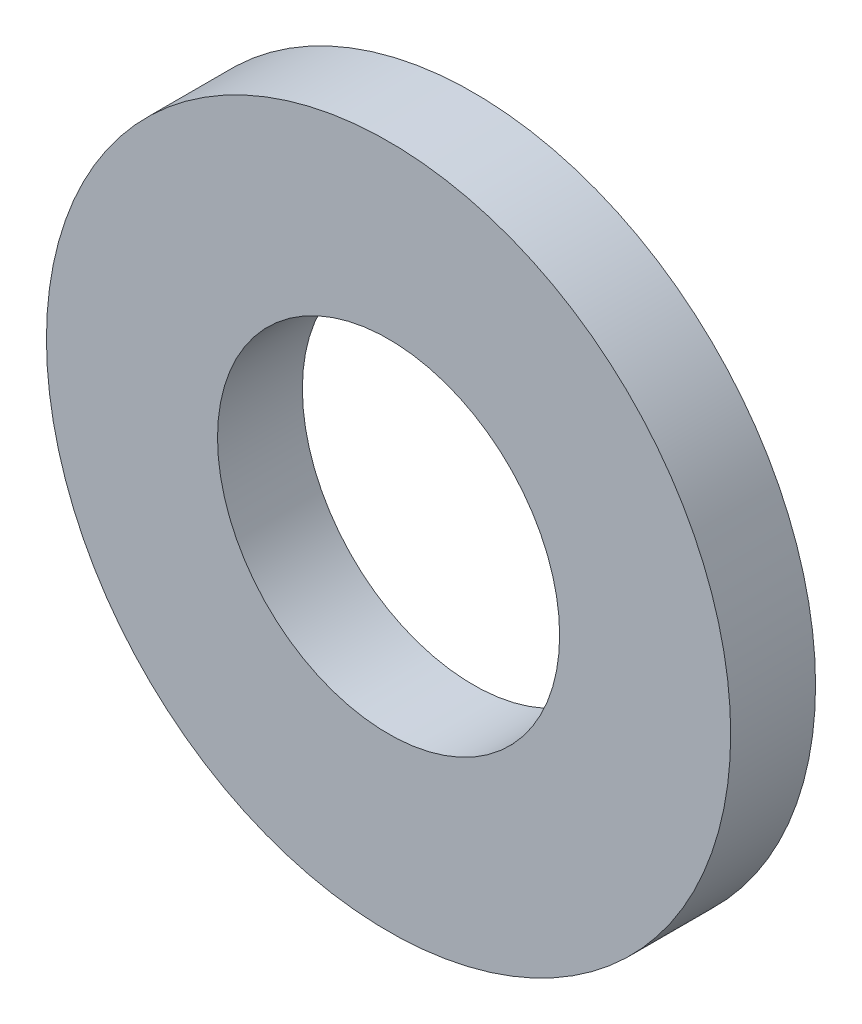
ISO-10303-21;
HEADER;
FILE_DESCRIPTION(('STEP AP214'),'2;1');
FILE_NAME('part.step','',(''),(''),'','','');
FILE_SCHEMA(('AUTOMOTIVE_DESIGN { 1 0 10303 214 1 1 1 1 }'));
ENDSEC;
DATA;
#1=APPLICATION_CONTEXT('core data for automotive mechanical design processes');
#2=APPLICATION_PROTOCOL_DEFINITION('international standard','automotive_design',2000,#1);
#3=PRODUCT_CONTEXT('',#1,'mechanical');
#4=PRODUCT('Part','Part','',(#3));
#5=PRODUCT_RELATED_PRODUCT_CATEGORY('part','',(#4));
#6=PRODUCT_DEFINITION_FORMATION('','',#4);
#7=PRODUCT_DEFINITION_CONTEXT('part definition',#1,'design');
#8=PRODUCT_DEFINITION('design','',#6,#7);
#9=PRODUCT_DEFINITION_SHAPE('','',#8);
#10=(LENGTH_UNIT() NAMED_UNIT(*) SI_UNIT(.MILLI.,.METRE.));
#11=(NAMED_UNIT(*) PLANE_ANGLE_UNIT() SI_UNIT($,.RADIAN.));
#12=(NAMED_UNIT(*) SI_UNIT($,.STERADIAN.) SOLID_ANGLE_UNIT());
#13=UNCERTAINTY_MEASURE_WITH_UNIT(LENGTH_MEASURE(1.E-05),#10,'distance_accuracy_value','');
#14=(GEOMETRIC_REPRESENTATION_CONTEXT(3) GLOBAL_UNCERTAINTY_ASSIGNED_CONTEXT((#13)) GLOBAL_UNIT_ASSIGNED_CONTEXT((#10,
#11,#12)) REPRESENTATION_CONTEXT('',''));
#15=CARTESIAN_POINT('',(0.,0.,0.));
#16=DIRECTION('',(0.,0.,1.));
#17=DIRECTION('',(1.,0.,0.));
#18=AXIS2_PLACEMENT_3D('',#15,#16,#17);
#19=CARTESIAN_POINT('',(0.,0.,0.7874));
#20=DIRECTION('',(0.,0.,1.));
#21=DIRECTION('',(1.,0.,0.));
#22=AXIS2_PLACEMENT_3D('',#19,#20,#21);
#23=PLANE('',#22);
#24=CARTESIAN_POINT('',(0.,0.,0.7874));
#25=DIRECTION('',(0.,0.,1.));
#26=DIRECTION('',(1.,0.,0.));
#27=AXIS2_PLACEMENT_3D('',#24,#25,#26);
#28=CIRCLE('',#27,6.35);
#29=CARTESIAN_POINT('',(6.35,0.,0.7874));
#30=VERTEX_POINT('',#29);
#31=EDGE_CURVE('E10',#30,#30,#28,.T.);
#32=ORIENTED_EDGE('',*,*,#31,.T.);
#33=EDGE_LOOP('',(#32));
#34=FACE_BOUND('',#33,.T.);
#35=CARTESIAN_POINT('',(0.,0.,0.7874));
#36=DIRECTION('',(0.,0.,1.));
#37=DIRECTION('',(1.,0.,0.));
#38=AXIS2_PLACEMENT_3D('',#35,#36,#37);
#39=CIRCLE('',#38,3.175);
#40=CARTESIAN_POINT('',(3.175,0.,0.7874));
#41=VERTEX_POINT('',#40);
#42=EDGE_CURVE('E37',#41,#41,#39,.T.);
#43=ORIENTED_EDGE('',*,*,#42,.F.);
#44=EDGE_LOOP('',(#43));
#45=FACE_BOUND('',#44,.T.);
#46=ADVANCED_FACE('F30',(#34,#45),#23,.T.);
#47=CARTESIAN_POINT('',(0.,0.,0.7874));
#48=DIRECTION('',(0.,0.,-1.));
#49=DIRECTION('',(-1.,0.,0.));
#50=AXIS2_PLACEMENT_3D('',#47,#48,#49);
#51=CYLINDRICAL_SURFACE('',#50,6.35);
#52=ORIENTED_EDGE('',*,*,#31,.F.);
#53=EDGE_LOOP('',(#52));
#54=FACE_BOUND('',#53,.T.);
#55=CARTESIAN_POINT('',(0.,0.,-0.7874));
#56=DIRECTION('',(0.,0.,1.));
#57=DIRECTION('',(1.,0.,0.));
#58=AXIS2_PLACEMENT_3D('',#55,#56,#57);
#59=CIRCLE('',#58,6.35);
#60=CARTESIAN_POINT('',(6.35,0.,-0.7874));
#61=VERTEX_POINT('',#60);
#62=EDGE_CURVE('E41',#61,#61,#59,.T.);
#63=ORIENTED_EDGE('',*,*,#62,.T.);
#64=EDGE_LOOP('',(#63));
#65=FACE_BOUND('',#64,.T.);
#66=ADVANCED_FACE('F32',(#54,#65),#51,.T.);
#67=CARTESIAN_POINT('',(0.,0.,0.7874));
#68=DIRECTION('',(0.,0.,-1.));
#69=DIRECTION('',(-1.,0.,0.));
#70=AXIS2_PLACEMENT_3D('',#67,#68,#69);
#71=CYLINDRICAL_SURFACE('',#70,3.175);
#72=ORIENTED_EDGE('',*,*,#42,.T.);
#73=EDGE_LOOP('',(#72));
#74=FACE_BOUND('',#73,.T.);
#75=CARTESIAN_POINT('',(0.,0.,-0.7874));
#76=DIRECTION('',(0.,0.,1.));
#77=DIRECTION('',(1.,0.,0.));
#78=AXIS2_PLACEMENT_3D('',#75,#76,#77);
#79=CIRCLE('',#78,3.175);
#80=CARTESIAN_POINT('',(3.175,0.,-0.7874));
#81=VERTEX_POINT('',#80);
#82=EDGE_CURVE('E45',#81,#81,#79,.T.);
#83=ORIENTED_EDGE('',*,*,#82,.F.);
#84=EDGE_LOOP('',(#83));
#85=FACE_BOUND('',#84,.T.);
#86=ADVANCED_FACE('F54',(#74,#85),#71,.F.);
#87=CARTESIAN_POINT('',(0.,0.,-0.7874));
#88=DIRECTION('',(0.,0.,1.));
#89=DIRECTION('',(1.,0.,0.));
#90=AXIS2_PLACEMENT_3D('',#87,#88,#89);
#91=PLANE('',#90);
#92=ORIENTED_EDGE('',*,*,#82,.T.);
#93=EDGE_LOOP('',(#92));
#94=FACE_BOUND('',#93,.T.);
#95=ORIENTED_EDGE('',*,*,#62,.F.);
#96=EDGE_LOOP('',(#95));
#97=FACE_BOUND('',#96,.T.);
#98=ADVANCED_FACE('F51',(#94,#97),#91,.F.);
#99=CLOSED_SHELL('',(#46,#66,#86,#98));
#100=MANIFOLD_SOLID_BREP('B2',#99);
#101=ADVANCED_BREP_SHAPE_REPRESENTATION('',(#18,#100),#14);
#102=SHAPE_DEFINITION_REPRESENTATION(#9,#101);
ENDSEC;
END-ISO-10303-21;
